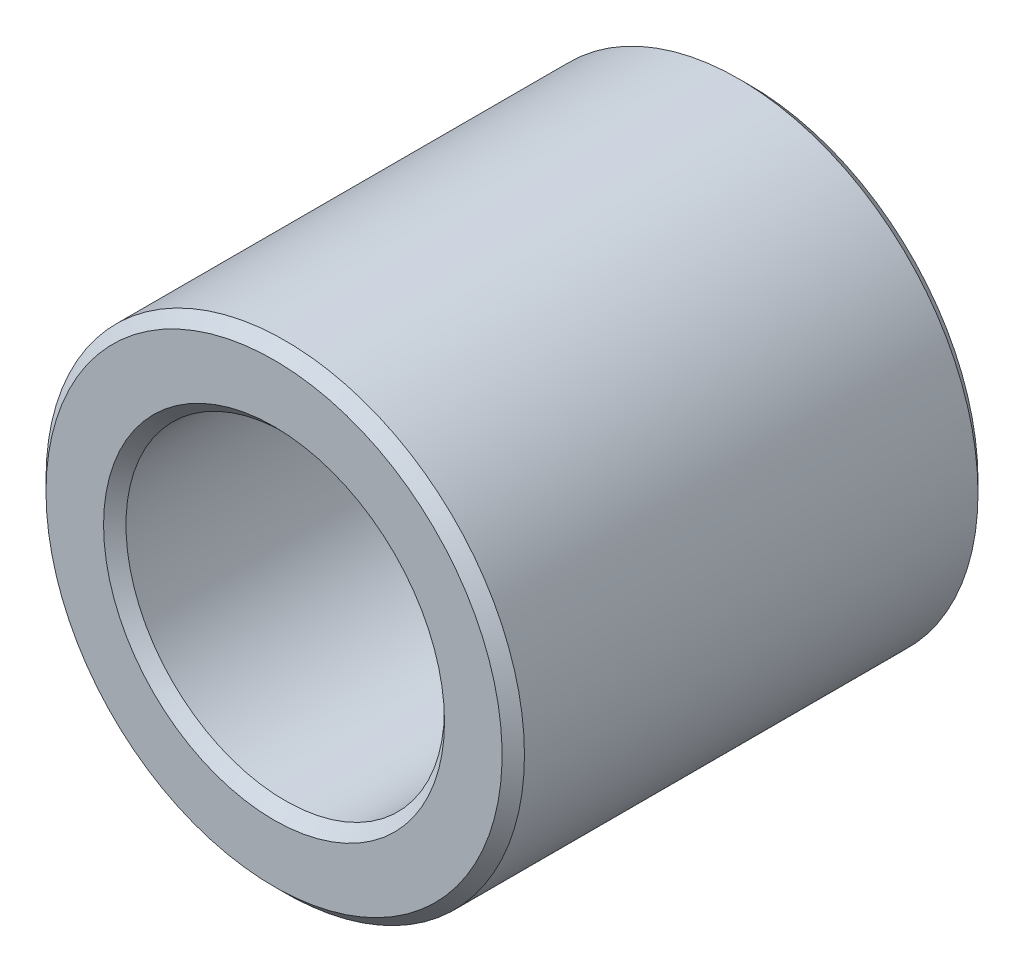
from build123d import *

# Parameters (mm, degrees)
BOSS_EXTRUDE1_DEPTH      = 4.7625
BOSS_EXTRUDE1_DEPTH_BACK = 4.7625
SKETCH14_R               = 4.7879
SKETCH14_R_2             = 3.1877
CHAMFER1_SIZE            = 0.224028


with BuildPart() as part:
    # Sketch14 → Boss-Extrude1 (new, two sides: drawn at the far end of the back side and taken through both)
    with BuildSketch(Plane.XY.offset(-BOSS_EXTRUDE1_DEPTH_BACK)):
        Circle(SKETCH14_R)
        Circle(SKETCH14_R_2, mode=Mode.SUBTRACT)
    extrude(amount=BOSS_EXTRUDE1_DEPTH + BOSS_EXTRUDE1_DEPTH_BACK)

    # Chamfer1
    chamfer1_edges = [part.edges().sort_by_distance(p)[0] for p in [
        (-4.7879, 0, -4.7625),
        (-3.1877, 0, -4.7625),
        (-4.7879, 0, 4.7625),
        (-3.1877, 0, 4.7625),
    ]]
    chamfer(chamfer1_edges, length=CHAMFER1_SIZE)


solid = part.part
